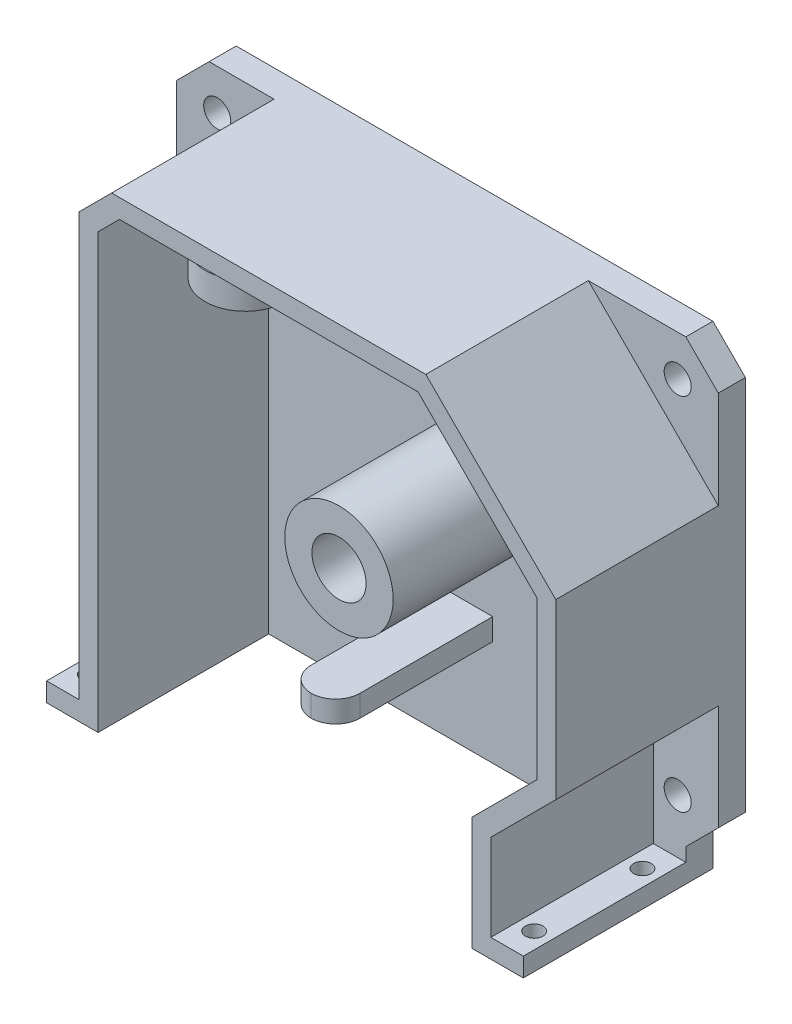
ISO-10303-21;
HEADER;
FILE_DESCRIPTION(('STEP AP214'),'2;1');
FILE_NAME('part.step','',(''),(''),'','','');
FILE_SCHEMA(('AUTOMOTIVE_DESIGN { 1 0 10303 214 1 1 1 1 }'));
ENDSEC;
DATA;
#1=APPLICATION_CONTEXT('core data for automotive mechanical design processes');
#2=APPLICATION_PROTOCOL_DEFINITION('international standard','automotive_design',2000,#1);
#3=PRODUCT_CONTEXT('',#1,'mechanical');
#4=PRODUCT('Part','Part','',(#3));
#5=PRODUCT_RELATED_PRODUCT_CATEGORY('part','',(#4));
#6=PRODUCT_DEFINITION_FORMATION('','',#4);
#7=PRODUCT_DEFINITION_CONTEXT('part definition',#1,'design');
#8=PRODUCT_DEFINITION('design','',#6,#7);
#9=PRODUCT_DEFINITION_SHAPE('','',#8);
#10=(LENGTH_UNIT() NAMED_UNIT(*) SI_UNIT(.MILLI.,.METRE.));
#11=(NAMED_UNIT(*) PLANE_ANGLE_UNIT() SI_UNIT($,.RADIAN.));
#12=(NAMED_UNIT(*) SI_UNIT($,.STERADIAN.) SOLID_ANGLE_UNIT());
#13=UNCERTAINTY_MEASURE_WITH_UNIT(LENGTH_MEASURE(1.E-05),#10,'distance_accuracy_value','');
#14=(GEOMETRIC_REPRESENTATION_CONTEXT(3) GLOBAL_UNCERTAINTY_ASSIGNED_CONTEXT((#13)) GLOBAL_UNIT_ASSIGNED_CONTEXT((#10,
#11,#12)) REPRESENTATION_CONTEXT('',''));
#15=CARTESIAN_POINT('',(0.,0.,0.));
#16=DIRECTION('',(0.,0.,1.));
#17=DIRECTION('',(1.,0.,0.));
#18=AXIS2_PLACEMENT_3D('',#15,#16,#17);
#19=CARTESIAN_POINT('',(0.,175.,7.));
#20=DIRECTION('',(0.,0.,-1.));
#21=DIRECTION('',(-1.,0.,0.));
#22=AXIS2_PLACEMENT_3D('',#19,#20,#21);
#23=PLANE('',#22);
#24=CARTESIAN_POINT('',(118.95,96.,7.));
#25=DIRECTION('',(0.,0.,-1.));
#26=DIRECTION('',(-1.,0.,0.));
#27=AXIS2_PLACEMENT_3D('',#24,#25,#26);
#28=CIRCLE('',#27,20.);
#29=CARTESIAN_POINT('',(98.95,96.,7.));
#30=VERTEX_POINT('',#29);
#31=EDGE_CURVE('E373',#30,#30,#28,.F.);
#32=ORIENTED_EDGE('',*,*,#31,.F.);
#33=EDGE_LOOP('',(#32));
#34=FACE_BOUND('',#33,.T.);
#35=DIRECTION('',(0.707106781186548,0.707106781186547,0.));
#36=VECTOR('',#35,1.);
#37=CARTESIAN_POINT('',(151.050252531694,23.9497474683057,7.));
#38=LINE('',#37,#36);
#39=CARTESIAN_POINT('',(169.,41.8994949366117,7.));
#40=VERTEX_POINT('',#39);
#41=CARTESIAN_POINT('',(193.,65.8994949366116,7.));
#42=VERTEX_POINT('',#41);
#43=EDGE_CURVE('E343',#40,#42,#38,.T.);
#44=ORIENTED_EDGE('',*,*,#43,.T.);
#45=DIRECTION('',(0.,1.,0.));
#46=VECTOR('',#45,1.);
#47=CARTESIAN_POINT('',(193.,175.,7.));
#48=LINE('',#47,#46);
#49=CARTESIAN_POINT('',(193.,124.100505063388,7.));
#50=VERTEX_POINT('',#49);
#51=EDGE_CURVE('E294',#42,#50,#48,.T.);
#52=ORIENTED_EDGE('',*,*,#51,.T.);
#53=DIRECTION('',(-0.707106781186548,0.707106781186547,0.));
#54=VECTOR('',#53,1.);
#55=CARTESIAN_POINT('',(71.0502525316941,246.050252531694,7.));
#56=LINE('',#55,#54);
#57=CARTESIAN_POINT('',(149.100505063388,168.,7.));
#58=VERTEX_POINT('',#57);
#59=EDGE_CURVE('E341',#50,#58,#56,.T.);
#60=ORIENTED_EDGE('',*,*,#59,.T.);
#61=DIRECTION('',(-1.,0.,0.));
#62=VECTOR('',#61,1.);
#63=CARTESIAN_POINT('',(0.,168.,7.));
#64=LINE('',#63,#62);
#65=CARTESIAN_POINT('',(38.8994949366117,168.,7.));
#66=VERTEX_POINT('',#65);
#67=EDGE_CURVE('E290',#58,#66,#64,.T.);
#68=ORIENTED_EDGE('',*,*,#67,.T.);
#69=DIRECTION('',(0.707106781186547,0.707106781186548,0.));
#70=VECTOR('',#69,1.);
#71=CARTESIAN_POINT('',(40.9497474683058,170.050252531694,7.00000000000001));
#72=LINE('',#71,#70);
#73=CARTESIAN_POINT('',(31.,160.100505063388,7.00000000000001));
#74=VERTEX_POINT('',#73);
#75=EDGE_CURVE('E293',#74,#66,#72,.T.);
#76=ORIENTED_EDGE('',*,*,#75,.F.);
#77=DIRECTION('',(0.,-1.,0.));
#78=VECTOR('',#77,1.);
#79=CARTESIAN_POINT('',(31.,175.,7.));
#80=LINE('',#79,#78);
#81=CARTESIAN_POINT('',(31.,0.,7.));
#82=VERTEX_POINT('',#81);
#83=EDGE_CURVE('E345',#74,#82,#80,.T.);
#84=ORIENTED_EDGE('',*,*,#83,.T.);
#85=DIRECTION('',(1.,0.,0.));
#86=VECTOR('',#85,1.);
#87=CARTESIAN_POINT('',(0.,0.,7.));
#88=LINE('',#87,#86);
#89=CARTESIAN_POINT('',(169.,0.,7.00000000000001));
#90=VERTEX_POINT('',#89);
#91=EDGE_CURVE('E297',#82,#90,#88,.T.);
#92=ORIENTED_EDGE('',*,*,#91,.T.);
#93=DIRECTION('',(0.,-1.,0.));
#94=VECTOR('',#93,1.);
#95=CARTESIAN_POINT('',(169.,39.,7.00000000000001));
#96=LINE('',#95,#94);
#97=EDGE_CURVE('E348',#40,#90,#96,.T.);
#98=ORIENTED_EDGE('',*,*,#97,.F.);
#99=EDGE_LOOP('',(#44,#52,#60,#68,#76,#84,#92,#98));
#100=FACE_BOUND('',#99,.T.);
#101=DIRECTION('',(0.,-1.,0.));
#102=VECTOR('',#101,1.);
#103=CARTESIAN_POINT('',(95.7,46.9,7.));
#104=LINE('',#103,#102);
#105=CARTESIAN_POINT('',(95.7,46.9,7.));
#106=VERTEX_POINT('',#105);
#107=CARTESIAN_POINT('',(95.7,38.9,7.));
#108=VERTEX_POINT('',#107);
#109=EDGE_CURVE('E246',#106,#108,#104,.T.);
#110=ORIENTED_EDGE('',*,*,#109,.F.);
#111=DIRECTION('',(-1.,0.,0.));
#112=VECTOR('',#111,1.);
#113=CARTESIAN_POINT('',(95.7,46.9,7.));
#114=LINE('',#113,#112);
#115=CARTESIAN_POINT('',(113.7,46.9,7.));
#116=VERTEX_POINT('',#115);
#117=EDGE_CURVE('E252',#116,#106,#114,.T.);
#118=ORIENTED_EDGE('',*,*,#117,.F.);
#119=DIRECTION('',(0.,1.,0.));
#120=VECTOR('',#119,1.);
#121=CARTESIAN_POINT('',(113.7,46.9,7.));
#122=LINE('',#121,#120);
#123=CARTESIAN_POINT('',(113.7,38.9,7.));
#124=VERTEX_POINT('',#123);
#125=EDGE_CURVE('E265',#124,#116,#122,.T.);
#126=ORIENTED_EDGE('',*,*,#125,.F.);
#127=DIRECTION('',(1.,0.,0.));
#128=VECTOR('',#127,1.);
#129=CARTESIAN_POINT('',(95.7,38.9,7.));
#130=LINE('',#129,#128);
#131=EDGE_CURVE('E260',#108,#124,#130,.T.);
#132=ORIENTED_EDGE('',*,*,#131,.F.);
#133=EDGE_LOOP('',(#110,#118,#126,#132));
#134=FACE_BOUND('',#133,.T.);
#135=ADVANCED_FACE('F26',(#34,#100,#134),#23,.F.);
#136=CARTESIAN_POINT('',(0.,168.,10.));
#137=DIRECTION('',(0.,-1.,0.));
#138=DIRECTION('',(0.,0.,-1.));
#139=AXIS2_PLACEMENT_3D('',#136,#137,#138);
#140=PLANE('',#139);
#141=DIRECTION('',(-1.,0.,0.));
#142=VECTOR('',#141,1.);
#143=CARTESIAN_POINT('',(0.,168.,70.));
#144=LINE('',#143,#142);
#145=CARTESIAN_POINT('',(149.100505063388,168.,70.));
#146=VERTEX_POINT('',#145);
#147=CARTESIAN_POINT('',(74.7905728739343,168.,70.));
#148=VERTEX_POINT('',#147);
#149=EDGE_CURVE('E333',#146,#148,#144,.T.);
#150=ORIENTED_EDGE('',*,*,#149,.T.);
#151=CARTESIAN_POINT('',(70.95,168.,55.5));
#152=DIRECTION('',(0.,-1.,0.));
#153=DIRECTION('',(0.,0.,-1.));
#154=AXIS2_PLACEMENT_3D('',#151,#152,#153);
#155=CIRCLE('',#154,15.);
#156=CARTESIAN_POINT('',(67.1094271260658,168.,70.));
#157=VERTEX_POINT('',#156);
#158=EDGE_CURVE('E376',#148,#157,#155,.F.);
#159=ORIENTED_EDGE('',*,*,#158,.T.);
#160=CARTESIAN_POINT('',(38.8994949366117,168.,70.));
#161=VERTEX_POINT('',#160);
#162=EDGE_CURVE('E332',#157,#161,#144,.T.);
#163=ORIENTED_EDGE('',*,*,#162,.T.);
#164=DIRECTION('',(0.,0.,-1.));
#165=VECTOR('',#164,1.);
#166=CARTESIAN_POINT('',(38.8994949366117,168.,70.));
#167=LINE('',#166,#165);
#168=EDGE_CURVE('E306',#161,#66,#167,.T.);
#169=ORIENTED_EDGE('',*,*,#168,.T.);
#170=ORIENTED_EDGE('',*,*,#67,.F.);
#171=DIRECTION('',(0.,0.,-1.));
#172=VECTOR('',#171,1.);
#173=CARTESIAN_POINT('',(149.100505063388,168.,10.));
#174=LINE('',#173,#172);
#175=EDGE_CURVE('E302',#146,#58,#174,.T.);
#176=ORIENTED_EDGE('',*,*,#175,.F.);
#177=EDGE_LOOP('',(#150,#159,#163,#169,#170,#176));
#178=FACE_BOUND('',#177,.T.);
#179=ADVANCED_FACE('F679',(#178),#140,.T.);
#180=CARTESIAN_POINT('',(0.,0.,10.));
#181=DIRECTION('',(0.,1.,0.));
#182=DIRECTION('',(0.,0.,1.));
#183=AXIS2_PLACEMENT_3D('',#180,#181,#182);
#184=PLANE('',#183);
#185=CARTESIAN_POINT('',(182.,0.,60.));
#186=DIRECTION('',(0.,-1.,0.));
#187=DIRECTION('',(0.,0.,1.));
#188=AXIS2_PLACEMENT_3D('',#185,#186,#187);
#189=CIRCLE('',#188,3.25000000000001);
#190=CARTESIAN_POINT('',(182.,0.,63.25));
#191=VERTEX_POINT('',#190);
#192=EDGE_CURVE('E445',#191,#191,#189,.T.);
#193=ORIENTED_EDGE('',*,*,#192,.F.);
#194=EDGE_LOOP('',(#193));
#195=FACE_BOUND('',#194,.T.);
#196=CARTESIAN_POINT('',(182.,0.,20.));
#197=DIRECTION('',(0.,-1.,0.));
#198=DIRECTION('',(0.,0.,1.));
#199=AXIS2_PLACEMENT_3D('',#196,#197,#198);
#200=CIRCLE('',#199,3.25000000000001);
#201=CARTESIAN_POINT('',(182.,0.,23.25));
#202=VERTEX_POINT('',#201);
#203=EDGE_CURVE('E439',#202,#202,#200,.T.);
#204=ORIENTED_EDGE('',*,*,#203,.F.);
#205=EDGE_LOOP('',(#204));
#206=FACE_BOUND('',#205,.T.);
#207=CARTESIAN_POINT('',(18.,0.,20.));
#208=DIRECTION('',(0.,-1.,0.));
#209=DIRECTION('',(0.,0.,-1.));
#210=AXIS2_PLACEMENT_3D('',#207,#208,#209);
#211=CIRCLE('',#210,3.25);
#212=CARTESIAN_POINT('',(18.,0.,16.75));
#213=VERTEX_POINT('',#212);
#214=EDGE_CURVE('E435',#213,#213,#211,.T.);
#215=ORIENTED_EDGE('',*,*,#214,.F.);
#216=EDGE_LOOP('',(#215));
#217=FACE_BOUND('',#216,.T.);
#218=CARTESIAN_POINT('',(18.,0.,60.));
#219=DIRECTION('',(0.,-1.,0.));
#220=DIRECTION('',(0.,0.,-1.));
#221=AXIS2_PLACEMENT_3D('',#218,#219,#220);
#222=CIRCLE('',#221,3.25);
#223=CARTESIAN_POINT('',(18.,0.,56.75));
#224=VERTEX_POINT('',#223);
#225=EDGE_CURVE('E429',#224,#224,#222,.T.);
#226=ORIENTED_EDGE('',*,*,#225,.F.);
#227=EDGE_LOOP('',(#226));
#228=FACE_BOUND('',#227,.T.);
#229=DIRECTION('',(0.,0.,-1.));
#230=VECTOR('',#229,1.);
#231=CARTESIAN_POINT('',(31.,0.,70.));
#232=LINE('',#231,#230);
#233=CARTESIAN_POINT('',(31.,0.,70.));
#234=VERTEX_POINT('',#233);
#235=EDGE_CURVE('E314',#234,#82,#232,.T.);
#236=ORIENTED_EDGE('',*,*,#235,.F.);
#237=DIRECTION('',(1.,0.,0.));
#238=VECTOR('',#237,1.);
#239=CARTESIAN_POINT('',(12.,0.,70.));
#240=LINE('',#239,#238);
#241=CARTESIAN_POINT('',(12.,0.,70.));
#242=VERTEX_POINT('',#241);
#243=EDGE_CURVE('E608',#242,#234,#240,.T.);
#244=ORIENTED_EDGE('',*,*,#243,.F.);
#245=DIRECTION('',(0.,0.,1.));
#246=VECTOR('',#245,1.);
#247=CARTESIAN_POINT('',(12.,0.,0.));
#248=LINE('',#247,#246);
#249=CARTESIAN_POINT('',(12.,0.,0.));
#250=VERTEX_POINT('',#249);
#251=EDGE_CURVE('E572',#250,#242,#248,.T.);
#252=ORIENTED_EDGE('',*,*,#251,.F.);
#253=DIRECTION('',(1.,0.,0.));
#254=VECTOR('',#253,1.);
#255=CARTESIAN_POINT('',(0.,0.,0.));
#256=LINE('',#255,#254);
#257=CARTESIAN_POINT('',(188.,0.,0.));
#258=VERTEX_POINT('',#257);
#259=EDGE_CURVE('E563',#250,#258,#256,.T.);
#260=ORIENTED_EDGE('',*,*,#259,.T.);
#261=DIRECTION('',(0.,0.,1.));
#262=VECTOR('',#261,1.);
#263=CARTESIAN_POINT('',(188.,0.,0.));
#264=LINE('',#263,#262);
#265=CARTESIAN_POINT('',(188.,0.,70.));
#266=VERTEX_POINT('',#265);
#267=EDGE_CURVE('E592',#258,#266,#264,.T.);
#268=ORIENTED_EDGE('',*,*,#267,.T.);
#269=CARTESIAN_POINT('',(169.,0.,70.));
#270=VERTEX_POINT('',#269);
#271=EDGE_CURVE('E602',#270,#266,#240,.T.);
#272=ORIENTED_EDGE('',*,*,#271,.F.);
#273=DIRECTION('',(0.,0.,-1.));
#274=VECTOR('',#273,1.);
#275=CARTESIAN_POINT('',(169.,0.,70.));
#276=LINE('',#275,#274);
#277=EDGE_CURVE('E317',#270,#90,#276,.T.);
#278=ORIENTED_EDGE('',*,*,#277,.T.);
#279=ORIENTED_EDGE('',*,*,#91,.F.);
#280=EDGE_LOOP('',(#236,#244,#252,#260,#268,#272,#278,#279));
#281=FACE_BOUND('',#280,.T.);
#282=ADVANCED_FACE('F685',(#195,#206,#217,#228,#281),#184,.F.);
#283=CARTESIAN_POINT('',(0.,175.,10.));
#284=DIRECTION('',(0.,0.,-1.));
#285=DIRECTION('',(-1.,0.,0.));
#286=AXIS2_PLACEMENT_3D('',#283,#284,#285);
#287=PLANE('',#286);
#288=CARTESIAN_POINT('',(15.,27.,10.));
#289=DIRECTION('',(0.,0.,1.));
#290=DIRECTION('',(1.,0.,0.));
#291=AXIS2_PLACEMENT_3D('',#288,#289,#290);
#292=CIRCLE('',#291,5.);
#293=CARTESIAN_POINT('',(20.,27.,10.));
#294=VERTEX_POINT('',#293);
#295=EDGE_CURVE('E411',#294,#294,#292,.T.);
#296=ORIENTED_EDGE('',*,*,#295,.F.);
#297=EDGE_LOOP('',(#296));
#298=FACE_BOUND('',#297,.T.);
#299=CARTESIAN_POINT('',(15.,160.,10.));
#300=DIRECTION('',(0.,0.,1.));
#301=DIRECTION('',(1.,0.,0.));
#302=AXIS2_PLACEMENT_3D('',#299,#300,#301);
#303=CIRCLE('',#302,5.);
#304=CARTESIAN_POINT('',(20.,160.,10.));
#305=VERTEX_POINT('',#304);
#306=EDGE_CURVE('E405',#305,#305,#303,.T.);
#307=ORIENTED_EDGE('',*,*,#306,.F.);
#308=EDGE_LOOP('',(#307));
#309=FACE_BOUND('',#308,.T.);
#310=DIRECTION('',(-1.,0.,0.));
#311=VECTOR('',#310,1.);
#312=CARTESIAN_POINT('',(12.,7.,10.));
#313=LINE('',#312,#311);
#314=CARTESIAN_POINT('',(24.,7.,10.));
#315=VERTEX_POINT('',#314);
#316=CARTESIAN_POINT('',(12.,7.,10.));
#317=VERTEX_POINT('',#316);
#318=EDGE_CURVE('E598',#315,#317,#313,.T.);
#319=ORIENTED_EDGE('',*,*,#318,.F.);
#320=DIRECTION('',(0.,-1.,0.));
#321=VECTOR('',#320,1.);
#322=CARTESIAN_POINT('',(24.,163.,10.));
#323=LINE('',#322,#321);
#324=CARTESIAN_POINT('',(24.,163.,10.));
#325=VERTEX_POINT('',#324);
#326=EDGE_CURVE('E603',#325,#315,#323,.T.);
#327=ORIENTED_EDGE('',*,*,#326,.F.);
#328=DIRECTION('',(-0.707106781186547,-0.707106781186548,0.));
#329=VECTOR('',#328,1.);
#330=CARTESIAN_POINT('',(36.,175.,10.));
#331=LINE('',#330,#329);
#332=CARTESIAN_POINT('',(36.,175.,10.));
#333=VERTEX_POINT('',#332);
#334=EDGE_CURVE('E528',#333,#325,#331,.T.);
#335=ORIENTED_EDGE('',*,*,#334,.F.);
#336=DIRECTION('',(-1.,0.,0.));
#337=VECTOR('',#336,1.);
#338=CARTESIAN_POINT('',(0.,175.,10.));
#339=LINE('',#338,#337);
#340=CARTESIAN_POINT('',(12.0000000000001,175.,10.));
#341=VERTEX_POINT('',#340);
#342=EDGE_CURVE('E498',#333,#341,#339,.T.);
#343=ORIENTED_EDGE('',*,*,#342,.T.);
#344=DIRECTION('',(0.70710678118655,0.707106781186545,0.));
#345=VECTOR('',#344,1.);
#346=CARTESIAN_POINT('',(0.,163.,10.));
#347=LINE('',#346,#345);
#348=CARTESIAN_POINT('',(0.,163.,10.));
#349=VERTEX_POINT('',#348);
#350=EDGE_CURVE('E525',#341,#349,#347,.F.);
#351=ORIENTED_EDGE('',*,*,#350,.T.);
#352=DIRECTION('',(0.,-1.,0.));
#353=VECTOR('',#352,1.);
#354=CARTESIAN_POINT('',(0.,0.,10.));
#355=LINE('',#354,#353);
#356=CARTESIAN_POINT('',(0.,24.,10.));
#357=VERTEX_POINT('',#356);
#358=EDGE_CURVE('E504',#349,#357,#355,.T.);
#359=ORIENTED_EDGE('',*,*,#358,.T.);
#360=DIRECTION('',(-0.707106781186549,0.707106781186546,0.));
#361=VECTOR('',#360,1.);
#362=CARTESIAN_POINT('',(0.,24.,10.));
#363=LINE('',#362,#361);
#364=CARTESIAN_POINT('',(12.,12.,10.));
#365=VERTEX_POINT('',#364);
#366=EDGE_CURVE('E585',#365,#357,#363,.T.);
#367=ORIENTED_EDGE('',*,*,#366,.F.);
#368=DIRECTION('',(0.,1.,0.));
#369=VECTOR('',#368,1.);
#370=CARTESIAN_POINT('',(12.,12.,10.));
#371=LINE('',#370,#369);
#372=EDGE_CURVE('E587',#317,#365,#371,.T.);
#373=ORIENTED_EDGE('',*,*,#372,.F.);
#374=EDGE_LOOP('',(#319,#327,#335,#343,#351,#359,#367,#373));
#375=FACE_BOUND('',#374,.T.);
#376=ADVANCED_FACE('F522',(#298,#309,#375),#287,.F.);
#377=CARTESIAN_POINT('',(185.,160.,10.));
#378=DIRECTION('',(0.,0.,1.));
#379=DIRECTION('',(1.,0.,0.));
#380=AXIS2_PLACEMENT_3D('',#377,#378,#379);
#381=CIRCLE('',#380,5.);
#382=CARTESIAN_POINT('',(190.,160.,10.));
#383=VERTEX_POINT('',#382);
#384=EDGE_CURVE('E417',#383,#383,#381,.T.);
#385=ORIENTED_EDGE('',*,*,#384,.F.);
#386=EDGE_LOOP('',(#385));
#387=FACE_BOUND('',#386,.T.);
#388=DIRECTION('',(-0.707106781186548,0.707106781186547,0.));
#389=VECTOR('',#388,1.);
#390=CARTESIAN_POINT('',(200.,127.,10.));
#391=LINE('',#390,#389);
#392=CARTESIAN_POINT('',(200.,127.,10.));
#393=VERTEX_POINT('',#392);
#394=CARTESIAN_POINT('',(152.,175.,10.));
#395=VERTEX_POINT('',#394);
#396=EDGE_CURVE('E363',#393,#395,#391,.T.);
#397=ORIENTED_EDGE('',*,*,#396,.F.);
#398=DIRECTION('',(0.,1.,0.));
#399=VECTOR('',#398,1.);
#400=CARTESIAN_POINT('',(200.,0.,10.));
#401=LINE('',#400,#399);
#402=CARTESIAN_POINT('',(200.,163.,10.));
#403=VERTEX_POINT('',#402);
#404=EDGE_CURVE('E499',#393,#403,#401,.T.);
#405=ORIENTED_EDGE('',*,*,#404,.T.);
#406=DIRECTION('',(0.707106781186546,-0.707106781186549,0.));
#407=VECTOR('',#406,1.);
#408=CARTESIAN_POINT('',(188.,175.,10.));
#409=LINE('',#408,#407);
#410=CARTESIAN_POINT('',(188.,175.,10.));
#411=VERTEX_POINT('',#410);
#412=EDGE_CURVE('E542',#403,#411,#409,.F.);
#413=ORIENTED_EDGE('',*,*,#412,.T.);
#414=EDGE_CURVE('E514',#411,#395,#339,.T.);
#415=ORIENTED_EDGE('',*,*,#414,.T.);
#416=EDGE_LOOP('',(#397,#405,#413,#415));
#417=FACE_BOUND('',#416,.T.);
#418=ADVANCED_FACE('F666',(#387,#417),#287,.F.);
#419=CARTESIAN_POINT('',(185.,27.,10.));
#420=DIRECTION('',(0.,0.,1.));
#421=DIRECTION('',(1.,0.,0.));
#422=AXIS2_PLACEMENT_3D('',#419,#420,#421);
#423=CIRCLE('',#422,5.);
#424=CARTESIAN_POINT('',(190.,27.,10.));
#425=VERTEX_POINT('',#424);
#426=EDGE_CURVE('E423',#425,#425,#423,.T.);
#427=ORIENTED_EDGE('',*,*,#426,.F.);
#428=EDGE_LOOP('',(#427));
#429=FACE_BOUND('',#428,.T.);
#430=DIRECTION('',(0.707106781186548,0.707106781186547,0.));
#431=VECTOR('',#430,1.);
#432=CARTESIAN_POINT('',(200.,63.,10.));
#433=LINE('',#432,#431);
#434=CARTESIAN_POINT('',(176.,39.,10.));
#435=VERTEX_POINT('',#434);
#436=CARTESIAN_POINT('',(200.,63.,10.));
#437=VERTEX_POINT('',#436);
#438=EDGE_CURVE('E354',#435,#437,#433,.T.);
#439=ORIENTED_EDGE('',*,*,#438,.F.);
#440=DIRECTION('',(0.,1.,0.));
#441=VECTOR('',#440,1.);
#442=CARTESIAN_POINT('',(176.,39.,10.));
#443=LINE('',#442,#441);
#444=CARTESIAN_POINT('',(176.,7.00000000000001,10.));
#445=VERTEX_POINT('',#444);
#446=EDGE_CURVE('E351',#445,#435,#443,.T.);
#447=ORIENTED_EDGE('',*,*,#446,.F.);
#448=DIRECTION('',(-1.,0.,0.));
#449=VECTOR('',#448,1.);
#450=CARTESIAN_POINT('',(176.,7.00000000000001,10.));
#451=LINE('',#450,#449);
#452=CARTESIAN_POINT('',(188.,7.00000000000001,10.));
#453=VERTEX_POINT('',#452);
#454=EDGE_CURVE('E350',#453,#445,#451,.T.);
#455=ORIENTED_EDGE('',*,*,#454,.F.);
#456=DIRECTION('',(0.,-1.,0.));
#457=VECTOR('',#456,1.);
#458=CARTESIAN_POINT('',(188.,12.,10.));
#459=LINE('',#458,#457);
#460=CARTESIAN_POINT('',(188.,12.,10.));
#461=VERTEX_POINT('',#460);
#462=EDGE_CURVE('E486',#461,#453,#459,.T.);
#463=ORIENTED_EDGE('',*,*,#462,.F.);
#464=DIRECTION('',(-0.707106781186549,-0.707106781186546,0.));
#465=VECTOR('',#464,1.);
#466=CARTESIAN_POINT('',(200.,24.,10.));
#467=LINE('',#466,#465);
#468=CARTESIAN_POINT('',(200.,24.,10.));
#469=VERTEX_POINT('',#468);
#470=EDGE_CURVE('E479',#469,#461,#467,.T.);
#471=ORIENTED_EDGE('',*,*,#470,.F.);
#472=EDGE_CURVE('E495',#469,#437,#401,.T.);
#473=ORIENTED_EDGE('',*,*,#472,.T.);
#474=EDGE_LOOP('',(#439,#447,#455,#463,#471,#473));
#475=FACE_BOUND('',#474,.T.);
#476=ADVANCED_FACE('F817',(#429,#475),#287,.F.);
#477=CARTESIAN_POINT('',(0.,0.,10.));
#478=DIRECTION('',(1.,0.,0.));
#479=DIRECTION('',(0.,0.,-1.));
#480=AXIS2_PLACEMENT_3D('',#477,#478,#479);
#481=PLANE('',#480);
#482=DIRECTION('',(0.,-1.,0.));
#483=VECTOR('',#482,1.);
#484=CARTESIAN_POINT('',(0.,0.,0.));
#485=LINE('',#484,#483);
#486=CARTESIAN_POINT('',(0.,163.,0.));
#487=VERTEX_POINT('',#486);
#488=CARTESIAN_POINT('',(0.,24.,0.));
#489=VERTEX_POINT('',#488);
#490=EDGE_CURVE('E568',#487,#489,#485,.T.);
#491=ORIENTED_EDGE('',*,*,#490,.T.);
#492=DIRECTION('',(0.,0.,1.));
#493=VECTOR('',#492,1.);
#494=CARTESIAN_POINT('',(0.,24.,0.));
#495=LINE('',#494,#493);
#496=EDGE_CURVE('E571',#489,#357,#495,.T.);
#497=ORIENTED_EDGE('',*,*,#496,.T.);
#498=ORIENTED_EDGE('',*,*,#358,.F.);
#499=DIRECTION('',(0.,0.,-1.));
#500=VECTOR('',#499,1.);
#501=CARTESIAN_POINT('',(0.,163.,10.));
#502=LINE('',#501,#500);
#503=EDGE_CURVE('E377',#349,#487,#502,.T.);
#504=ORIENTED_EDGE('',*,*,#503,.T.);
#505=EDGE_LOOP('',(#491,#497,#498,#504));
#506=FACE_BOUND('',#505,.T.);
#507=ADVANCED_FACE('F28',(#506),#481,.F.);
#508=CARTESIAN_POINT('',(200.,0.,10.));
#509=DIRECTION('',(-1.,0.,0.));
#510=DIRECTION('',(0.,0.,1.));
#511=AXIS2_PLACEMENT_3D('',#508,#509,#510);
#512=PLANE('',#511);
#513=ORIENTED_EDGE('',*,*,#472,.F.);
#514=DIRECTION('',(0.,0.,1.));
#515=VECTOR('',#514,1.);
#516=CARTESIAN_POINT('',(200.,24.,0.));
#517=LINE('',#516,#515);
#518=CARTESIAN_POINT('',(200.,24.,0.));
#519=VERTEX_POINT('',#518);
#520=EDGE_CURVE('E590',#519,#469,#517,.T.);
#521=ORIENTED_EDGE('',*,*,#520,.F.);
#522=DIRECTION('',(0.,1.,0.));
#523=VECTOR('',#522,1.);
#524=CARTESIAN_POINT('',(200.,0.,0.));
#525=LINE('',#524,#523);
#526=CARTESIAN_POINT('',(200.,163.,0.));
#527=VERTEX_POINT('',#526);
#528=EDGE_CURVE('E562',#519,#527,#525,.T.);
#529=ORIENTED_EDGE('',*,*,#528,.T.);
#530=DIRECTION('',(0.,0.,1.));
#531=VECTOR('',#530,1.);
#532=CARTESIAN_POINT('',(200.,163.,10.));
#533=LINE('',#532,#531);
#534=EDGE_CURVE('E543',#527,#403,#533,.T.);
#535=ORIENTED_EDGE('',*,*,#534,.T.);
#536=ORIENTED_EDGE('',*,*,#404,.F.);
#537=DIRECTION('',(0.,0.,-1.));
#538=VECTOR('',#537,1.);
#539=CARTESIAN_POINT('',(200.,127.,70.));
#540=LINE('',#539,#538);
#541=CARTESIAN_POINT('',(200.,127.,70.));
#542=VERTEX_POINT('',#541);
#543=EDGE_CURVE('E370',#542,#393,#540,.T.);
#544=ORIENTED_EDGE('',*,*,#543,.F.);
#545=DIRECTION('',(0.,1.,0.));
#546=VECTOR('',#545,1.);
#547=CARTESIAN_POINT('',(200.,63.,70.));
#548=LINE('',#547,#546);
#549=CARTESIAN_POINT('',(200.,63.,70.));
#550=VERTEX_POINT('',#549);
#551=EDGE_CURVE('E618',#550,#542,#548,.T.);
#552=ORIENTED_EDGE('',*,*,#551,.F.);
#553=DIRECTION('',(0.,0.,-1.));
#554=VECTOR('',#553,1.);
#555=CARTESIAN_POINT('',(200.,63.,70.));
#556=LINE('',#555,#554);
#557=EDGE_CURVE('E366',#550,#437,#556,.T.);
#558=ORIENTED_EDGE('',*,*,#557,.T.);
#559=EDGE_LOOP('',(#513,#521,#529,#535,#536,#544,#552,#558));
#560=FACE_BOUND('',#559,.T.);
#561=ADVANCED_FACE('F665',(#560),#512,.F.);
#562=CARTESIAN_POINT('',(0.,175.,10.));
#563=DIRECTION('',(0.,-1.,0.));
#564=DIRECTION('',(0.,0.,-1.));
#565=AXIS2_PLACEMENT_3D('',#562,#563,#564);
#566=PLANE('',#565);
#567=ORIENTED_EDGE('',*,*,#414,.F.);
#568=DIRECTION('',(0.,0.,-1.));
#569=VECTOR('',#568,1.);
#570=CARTESIAN_POINT('',(188.,175.,10.));
#571=LINE('',#570,#569);
#572=CARTESIAN_POINT('',(188.,175.,0.));
#573=VERTEX_POINT('',#572);
#574=EDGE_CURVE('E519',#411,#573,#571,.T.);
#575=ORIENTED_EDGE('',*,*,#574,.T.);
#576=DIRECTION('',(-1.,0.,0.));
#577=VECTOR('',#576,1.);
#578=CARTESIAN_POINT('',(0.,175.,0.));
#579=LINE('',#578,#577);
#580=CARTESIAN_POINT('',(12.0000000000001,175.,0.));
#581=VERTEX_POINT('',#580);
#582=EDGE_CURVE('E537',#573,#581,#579,.T.);
#583=ORIENTED_EDGE('',*,*,#582,.T.);
#584=DIRECTION('',(0.,0.,1.));
#585=VECTOR('',#584,1.);
#586=CARTESIAN_POINT('',(12.0000000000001,175.,10.));
#587=LINE('',#586,#585);
#588=EDGE_CURVE('E509',#581,#341,#587,.T.);
#589=ORIENTED_EDGE('',*,*,#588,.T.);
#590=ORIENTED_EDGE('',*,*,#342,.F.);
#591=DIRECTION('',(0.,0.,-1.));
#592=VECTOR('',#591,1.);
#593=CARTESIAN_POINT('',(36.,175.,70.));
#594=LINE('',#593,#592);
#595=CARTESIAN_POINT('',(36.,175.,70.));
#596=VERTEX_POINT('',#595);
#597=EDGE_CURVE('E637',#596,#333,#594,.T.);
#598=ORIENTED_EDGE('',*,*,#597,.F.);
#599=DIRECTION('',(-1.,0.,0.));
#600=VECTOR('',#599,1.);
#601=CARTESIAN_POINT('',(152.,175.,70.));
#602=LINE('',#601,#600);
#603=CARTESIAN_POINT('',(152.,175.,70.));
#604=VERTEX_POINT('',#603);
#605=EDGE_CURVE('E622',#604,#596,#602,.T.);
#606=ORIENTED_EDGE('',*,*,#605,.F.);
#607=DIRECTION('',(0.,0.,-1.));
#608=VECTOR('',#607,1.);
#609=CARTESIAN_POINT('',(152.,175.,70.));
#610=LINE('',#609,#608);
#611=EDGE_CURVE('E642',#604,#395,#610,.T.);
#612=ORIENTED_EDGE('',*,*,#611,.T.);
#613=EDGE_LOOP('',(#567,#575,#583,#589,#590,#598,#606,#612));
#614=FACE_BOUND('',#613,.T.);
#615=ADVANCED_FACE('F534',(#614),#566,.F.);
#616=CARTESIAN_POINT('',(0.,175.,0.));
#617=DIRECTION('',(0.,0.,-1.));
#618=DIRECTION('',(-1.,0.,0.));
#619=AXIS2_PLACEMENT_3D('',#616,#617,#618);
#620=PLANE('',#619);
#621=CARTESIAN_POINT('',(185.,27.,0.));
#622=DIRECTION('',(0.,0.,1.));
#623=DIRECTION('',(1.,0.,0.));
#624=AXIS2_PLACEMENT_3D('',#621,#622,#623);
#625=CIRCLE('',#624,5.);
#626=CARTESIAN_POINT('',(190.,27.,0.));
#627=VERTEX_POINT('',#626);
#628=EDGE_CURVE('E420',#627,#627,#625,.T.);
#629=ORIENTED_EDGE('',*,*,#628,.T.);
#630=EDGE_LOOP('',(#629));
#631=FACE_BOUND('',#630,.T.);
#632=CARTESIAN_POINT('',(185.,160.,0.));
#633=DIRECTION('',(0.,0.,1.));
#634=DIRECTION('',(1.,0.,0.));
#635=AXIS2_PLACEMENT_3D('',#632,#633,#634);
#636=CIRCLE('',#635,5.);
#637=CARTESIAN_POINT('',(190.,160.,0.));
#638=VERTEX_POINT('',#637);
#639=EDGE_CURVE('E414',#638,#638,#636,.T.);
#640=ORIENTED_EDGE('',*,*,#639,.T.);
#641=EDGE_LOOP('',(#640));
#642=FACE_BOUND('',#641,.T.);
#643=CARTESIAN_POINT('',(15.,27.,0.));
#644=DIRECTION('',(0.,0.,1.));
#645=DIRECTION('',(1.,0.,0.));
#646=AXIS2_PLACEMENT_3D('',#643,#644,#645);
#647=CIRCLE('',#646,5.);
#648=CARTESIAN_POINT('',(20.,27.,0.));
#649=VERTEX_POINT('',#648);
#650=EDGE_CURVE('E408',#649,#649,#647,.T.);
#651=ORIENTED_EDGE('',*,*,#650,.T.);
#652=EDGE_LOOP('',(#651));
#653=FACE_BOUND('',#652,.T.);
#654=CARTESIAN_POINT('',(15.,160.,0.));
#655=DIRECTION('',(0.,0.,1.));
#656=DIRECTION('',(1.,0.,0.));
#657=AXIS2_PLACEMENT_3D('',#654,#655,#656);
#658=CIRCLE('',#657,5.);
#659=CARTESIAN_POINT('',(20.,160.,0.));
#660=VERTEX_POINT('',#659);
#661=EDGE_CURVE('E402',#660,#660,#658,.T.);
#662=ORIENTED_EDGE('',*,*,#661,.T.);
#663=EDGE_LOOP('',(#662));
#664=FACE_BOUND('',#663,.T.);
#665=DIRECTION('',(0.,-1.,0.));
#666=VECTOR('',#665,1.);
#667=CARTESIAN_POINT('',(188.,12.,0.));
#668=LINE('',#667,#666);
#669=CARTESIAN_POINT('',(188.,12.0000000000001,0.));
#670=VERTEX_POINT('',#669);
#671=EDGE_CURVE('E820',#670,#258,#668,.T.);
#672=ORIENTED_EDGE('',*,*,#671,.T.);
#673=ORIENTED_EDGE('',*,*,#259,.F.);
#674=DIRECTION('',(0.,1.,0.));
#675=VECTOR('',#674,1.);
#676=CARTESIAN_POINT('',(12.,12.,0.));
#677=LINE('',#676,#675);
#678=CARTESIAN_POINT('',(12.,12.,0.));
#679=VERTEX_POINT('',#678);
#680=EDGE_CURVE('E582',#250,#679,#677,.T.);
#681=ORIENTED_EDGE('',*,*,#680,.T.);
#682=DIRECTION('',(-0.707106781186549,0.707106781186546,0.));
#683=VECTOR('',#682,1.);
#684=CARTESIAN_POINT('',(0.,24.,0.));
#685=LINE('',#684,#683);
#686=EDGE_CURVE('E575',#679,#489,#685,.T.);
#687=ORIENTED_EDGE('',*,*,#686,.T.);
#688=ORIENTED_EDGE('',*,*,#490,.F.);
#689=DIRECTION('',(-0.70710678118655,-0.707106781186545,0.));
#690=VECTOR('',#689,1.);
#691=CARTESIAN_POINT('',(5.99999999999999,169.,0.));
#692=LINE('',#691,#690);
#693=EDGE_CURVE('E551',#487,#581,#692,.F.);
#694=ORIENTED_EDGE('',*,*,#693,.T.);
#695=ORIENTED_EDGE('',*,*,#582,.F.);
#696=DIRECTION('',(-0.707106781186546,0.707106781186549,0.));
#697=VECTOR('',#696,1.);
#698=CARTESIAN_POINT('',(94.0000000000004,269.,0.));
#699=LINE('',#698,#697);
#700=EDGE_CURVE('E546',#573,#527,#699,.F.);
#701=ORIENTED_EDGE('',*,*,#700,.T.);
#702=ORIENTED_EDGE('',*,*,#528,.F.);
#703=DIRECTION('',(-0.707106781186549,-0.707106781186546,0.));
#704=VECTOR('',#703,1.);
#705=CARTESIAN_POINT('',(200.,24.,0.));
#706=LINE('',#705,#704);
#707=EDGE_CURVE('E489',#519,#670,#706,.T.);
#708=ORIENTED_EDGE('',*,*,#707,.T.);
#709=EDGE_LOOP('',(#672,#673,#681,#687,#688,#694,#695,#701,#702,#708));
#710=FACE_BOUND('',#709,.T.);
#711=ADVANCED_FACE('F558',(#631,#642,#653,#664,#710),#620,.T.);
#712=CARTESIAN_POINT('',(188.,175.,10.));
#713=DIRECTION('',(-0.707106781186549,-0.707106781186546,0.));
#714=DIRECTION('',(0.707106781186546,-0.707106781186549,0.));
#715=AXIS2_PLACEMENT_3D('',#712,#713,#714);
#716=PLANE('',#715);
#717=ORIENTED_EDGE('',*,*,#412,.F.);
#718=ORIENTED_EDGE('',*,*,#534,.F.);
#719=ORIENTED_EDGE('',*,*,#700,.F.);
#720=ORIENTED_EDGE('',*,*,#574,.F.);
#721=EDGE_LOOP('',(#717,#718,#719,#720));
#722=FACE_BOUND('',#721,.T.);
#723=ADVANCED_FACE('F667',(#722),#716,.F.);
#724=CARTESIAN_POINT('',(0.,163.,10.));
#725=DIRECTION('',(0.707106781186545,-0.70710678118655,0.));
#726=DIRECTION('',(0.70710678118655,0.707106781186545,0.));
#727=AXIS2_PLACEMENT_3D('',#724,#725,#726);
#728=PLANE('',#727);
#729=ORIENTED_EDGE('',*,*,#350,.F.);
#730=ORIENTED_EDGE('',*,*,#588,.F.);
#731=ORIENTED_EDGE('',*,*,#693,.F.);
#732=ORIENTED_EDGE('',*,*,#503,.F.);
#733=EDGE_LOOP('',(#729,#730,#731,#732));
#734=FACE_BOUND('',#733,.T.);
#735=ADVANCED_FACE('F540',(#734),#728,.F.);
#736=CARTESIAN_POINT('',(0.,24.,0.));
#737=DIRECTION('',(0.707106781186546,0.707106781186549,0.));
#738=DIRECTION('',(-0.707106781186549,0.707106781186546,0.));
#739=AXIS2_PLACEMENT_3D('',#736,#737,#738);
#740=PLANE('',#739);
#741=ORIENTED_EDGE('',*,*,#366,.T.);
#742=ORIENTED_EDGE('',*,*,#496,.F.);
#743=ORIENTED_EDGE('',*,*,#686,.F.);
#744=DIRECTION('',(0.,0.,1.));
#745=VECTOR('',#744,1.);
#746=CARTESIAN_POINT('',(12.,12.,0.));
#747=LINE('',#746,#745);
#748=EDGE_CURVE('E574',#679,#365,#747,.T.);
#749=ORIENTED_EDGE('',*,*,#748,.T.);
#750=EDGE_LOOP('',(#741,#742,#743,#749));
#751=FACE_BOUND('',#750,.T.);
#752=ADVANCED_FACE('F674',(#751),#740,.F.);
#753=CARTESIAN_POINT('',(12.,12.,0.));
#754=DIRECTION('',(1.,0.,0.));
#755=DIRECTION('',(0.,0.,-1.));
#756=AXIS2_PLACEMENT_3D('',#753,#754,#755);
#757=PLANE('',#756);
#758=ORIENTED_EDGE('',*,*,#251,.T.);
#759=DIRECTION('',(0.,-1.,0.));
#760=VECTOR('',#759,1.);
#761=CARTESIAN_POINT('',(12.,0.,70.));
#762=LINE('',#761,#760);
#763=CARTESIAN_POINT('',(12.,7.,70.));
#764=VERTEX_POINT('',#763);
#765=EDGE_CURVE('E630',#764,#242,#762,.T.);
#766=ORIENTED_EDGE('',*,*,#765,.F.);
#767=DIRECTION('',(0.,0.,-1.));
#768=VECTOR('',#767,1.);
#769=CARTESIAN_POINT('',(12.,7.,70.));
#770=LINE('',#769,#768);
#771=EDGE_CURVE('E604',#764,#317,#770,.T.);
#772=ORIENTED_EDGE('',*,*,#771,.T.);
#773=ORIENTED_EDGE('',*,*,#372,.T.);
#774=ORIENTED_EDGE('',*,*,#748,.F.);
#775=ORIENTED_EDGE('',*,*,#680,.F.);
#776=EDGE_LOOP('',(#758,#766,#772,#773,#774,#775));
#777=FACE_BOUND('',#776,.T.);
#778=ADVANCED_FACE('F739',(#777),#757,.F.);
#779=CARTESIAN_POINT('',(188.,12.,0.));
#780=DIRECTION('',(-1.,0.,0.));
#781=DIRECTION('',(0.,0.,1.));
#782=AXIS2_PLACEMENT_3D('',#779,#780,#781);
#783=PLANE('',#782);
#784=ORIENTED_EDGE('',*,*,#462,.T.);
#785=DIRECTION('',(0.,0.,-1.));
#786=VECTOR('',#785,1.);
#787=CARTESIAN_POINT('',(188.,7.,70.));
#788=LINE('',#787,#786);
#789=CARTESIAN_POINT('',(188.,7.,70.));
#790=VERTEX_POINT('',#789);
#791=EDGE_CURVE('E469',#790,#453,#788,.T.);
#792=ORIENTED_EDGE('',*,*,#791,.F.);
#793=DIRECTION('',(0.,1.,0.));
#794=VECTOR('',#793,1.);
#795=CARTESIAN_POINT('',(188.,0.,70.));
#796=LINE('',#795,#794);
#797=EDGE_CURVE('E611',#266,#790,#796,.T.);
#798=ORIENTED_EDGE('',*,*,#797,.F.);
#799=ORIENTED_EDGE('',*,*,#267,.F.);
#800=ORIENTED_EDGE('',*,*,#671,.F.);
#801=DIRECTION('',(0.,0.,1.));
#802=VECTOR('',#801,1.);
#803=CARTESIAN_POINT('',(188.,12.,0.));
#804=LINE('',#803,#802);
#805=EDGE_CURVE('E811',#670,#461,#804,.T.);
#806=ORIENTED_EDGE('',*,*,#805,.T.);
#807=EDGE_LOOP('',(#784,#792,#798,#799,#800,#806));
#808=FACE_BOUND('',#807,.T.);
#809=ADVANCED_FACE('F736',(#808),#783,.F.);
#810=CARTESIAN_POINT('',(200.,24.,0.));
#811=DIRECTION('',(-0.707106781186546,0.707106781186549,0.));
#812=DIRECTION('',(-0.707106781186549,-0.707106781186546,0.));
#813=AXIS2_PLACEMENT_3D('',#810,#811,#812);
#814=PLANE('',#813);
#815=ORIENTED_EDGE('',*,*,#470,.T.);
#816=ORIENTED_EDGE('',*,*,#805,.F.);
#817=ORIENTED_EDGE('',*,*,#707,.F.);
#818=ORIENTED_EDGE('',*,*,#520,.T.);
#819=EDGE_LOOP('',(#815,#816,#817,#818));
#820=FACE_BOUND('',#819,.T.);
#821=ADVANCED_FACE('F457',(#820),#814,.F.);
#822=CARTESIAN_POINT('',(176.,7.00000000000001,70.));
#823=DIRECTION('',(0.,-1.,0.));
#824=DIRECTION('',(1.,0.,0.));
#825=AXIS2_PLACEMENT_3D('',#822,#823,#824);
#826=PLANE('',#825);
#827=CARTESIAN_POINT('',(182.,7.00000000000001,60.));
#828=DIRECTION('',(0.,-1.,0.));
#829=DIRECTION('',(1.,0.,0.));
#830=AXIS2_PLACEMENT_3D('',#827,#828,#829);
#831=CIRCLE('',#830,3.25000000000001);
#832=CARTESIAN_POINT('',(185.25,7.00000000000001,60.));
#833=VERTEX_POINT('',#832);
#834=EDGE_CURVE('E442',#833,#833,#831,.F.);
#835=ORIENTED_EDGE('',*,*,#834,.F.);
#836=EDGE_LOOP('',(#835));
#837=FACE_BOUND('',#836,.T.);
#838=CARTESIAN_POINT('',(182.,7.00000000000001,20.));
#839=DIRECTION('',(0.,-1.,0.));
#840=DIRECTION('',(1.,0.,0.));
#841=AXIS2_PLACEMENT_3D('',#838,#839,#840);
#842=CIRCLE('',#841,3.25000000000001);
#843=CARTESIAN_POINT('',(185.25,7.00000000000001,20.));
#844=VERTEX_POINT('',#843);
#845=EDGE_CURVE('E438',#844,#844,#842,.F.);
#846=ORIENTED_EDGE('',*,*,#845,.F.);
#847=EDGE_LOOP('',(#846));
#848=FACE_BOUND('',#847,.T.);
#849=ORIENTED_EDGE('',*,*,#454,.T.);
#850=DIRECTION('',(0.,0.,-1.));
#851=VECTOR('',#850,1.);
#852=CARTESIAN_POINT('',(176.,7.00000000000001,70.));
#853=LINE('',#852,#851);
#854=CARTESIAN_POINT('',(176.,7.00000000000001,70.));
#855=VERTEX_POINT('',#854);
#856=EDGE_CURVE('E466',#855,#445,#853,.T.);
#857=ORIENTED_EDGE('',*,*,#856,.F.);
#858=DIRECTION('',(-1.,0.,0.));
#859=VECTOR('',#858,1.);
#860=CARTESIAN_POINT('',(176.,7.00000000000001,70.));
#861=LINE('',#860,#859);
#862=EDGE_CURVE('E613',#790,#855,#861,.T.);
#863=ORIENTED_EDGE('',*,*,#862,.F.);
#864=ORIENTED_EDGE('',*,*,#791,.T.);
#865=EDGE_LOOP('',(#849,#857,#863,#864));
#866=FACE_BOUND('',#865,.T.);
#867=ADVANCED_FACE('F453',(#837,#848,#866),#826,.F.);
#868=CARTESIAN_POINT('',(176.,39.,70.));
#869=DIRECTION('',(-1.,0.,0.));
#870=DIRECTION('',(0.,-1.,0.));
#871=AXIS2_PLACEMENT_3D('',#868,#869,#870);
#872=PLANE('',#871);
#873=ORIENTED_EDGE('',*,*,#446,.T.);
#874=DIRECTION('',(0.,0.,-1.));
#875=VECTOR('',#874,1.);
#876=CARTESIAN_POINT('',(176.,39.,70.));
#877=LINE('',#876,#875);
#878=CARTESIAN_POINT('',(176.,39.,70.));
#879=VERTEX_POINT('',#878);
#880=EDGE_CURVE('E369',#879,#435,#877,.T.);
#881=ORIENTED_EDGE('',*,*,#880,.F.);
#882=DIRECTION('',(0.,1.,0.));
#883=VECTOR('',#882,1.);
#884=CARTESIAN_POINT('',(176.,39.,70.));
#885=LINE('',#884,#883);
#886=EDGE_CURVE('E477',#855,#879,#885,.T.);
#887=ORIENTED_EDGE('',*,*,#886,.F.);
#888=ORIENTED_EDGE('',*,*,#856,.T.);
#889=EDGE_LOOP('',(#873,#881,#887,#888));
#890=FACE_BOUND('',#889,.T.);
#891=ADVANCED_FACE('F456',(#890),#872,.F.);
#892=CARTESIAN_POINT('',(200.,63.,70.));
#893=DIRECTION('',(-0.707106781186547,0.707106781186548,0.));
#894=DIRECTION('',(-0.707106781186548,-0.707106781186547,0.));
#895=AXIS2_PLACEMENT_3D('',#892,#893,#894);
#896=PLANE('',#895);
#897=ORIENTED_EDGE('',*,*,#438,.T.);
#898=ORIENTED_EDGE('',*,*,#557,.F.);
#899=DIRECTION('',(0.707106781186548,0.707106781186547,0.));
#900=VECTOR('',#899,1.);
#901=CARTESIAN_POINT('',(200.,63.,70.));
#902=LINE('',#901,#900);
#903=EDGE_CURVE('E616',#879,#550,#902,.T.);
#904=ORIENTED_EDGE('',*,*,#903,.F.);
#905=ORIENTED_EDGE('',*,*,#880,.T.);
#906=EDGE_LOOP('',(#897,#898,#904,#905));
#907=FACE_BOUND('',#906,.T.);
#908=ADVANCED_FACE('F730',(#907),#896,.F.);
#909=CARTESIAN_POINT('',(200.,127.,70.));
#910=DIRECTION('',(-0.707106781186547,-0.707106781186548,0.));
#911=DIRECTION('',(0.707106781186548,-0.707106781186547,0.));
#912=AXIS2_PLACEMENT_3D('',#909,#910,#911);
#913=PLANE('',#912);
#914=ORIENTED_EDGE('',*,*,#396,.T.);
#915=ORIENTED_EDGE('',*,*,#611,.F.);
#916=DIRECTION('',(-0.707106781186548,0.707106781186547,0.));
#917=VECTOR('',#916,1.);
#918=CARTESIAN_POINT('',(200.,127.,70.));
#919=LINE('',#918,#917);
#920=EDGE_CURVE('E620',#542,#604,#919,.T.);
#921=ORIENTED_EDGE('',*,*,#920,.F.);
#922=ORIENTED_EDGE('',*,*,#543,.T.);
#923=EDGE_LOOP('',(#914,#915,#921,#922));
#924=FACE_BOUND('',#923,.T.);
#925=ADVANCED_FACE('F659',(#924),#913,.F.);
#926=CARTESIAN_POINT('',(36.,175.,70.));
#927=DIRECTION('',(0.707106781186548,-0.707106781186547,0.));
#928=DIRECTION('',(0.707106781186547,0.707106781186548,0.));
#929=AXIS2_PLACEMENT_3D('',#926,#927,#928);
#930=PLANE('',#929);
#931=ORIENTED_EDGE('',*,*,#334,.T.);
#932=DIRECTION('',(0.,0.,-1.));
#933=VECTOR('',#932,1.);
#934=CARTESIAN_POINT('',(24.,163.,70.));
#935=LINE('',#934,#933);
#936=CARTESIAN_POINT('',(24.,163.,70.));
#937=VERTEX_POINT('',#936);
#938=EDGE_CURVE('E635',#937,#325,#935,.T.);
#939=ORIENTED_EDGE('',*,*,#938,.F.);
#940=DIRECTION('',(-0.707106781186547,-0.707106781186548,0.));
#941=VECTOR('',#940,1.);
#942=CARTESIAN_POINT('',(36.,175.,70.));
#943=LINE('',#942,#941);
#944=EDGE_CURVE('E624',#596,#937,#943,.T.);
#945=ORIENTED_EDGE('',*,*,#944,.F.);
#946=ORIENTED_EDGE('',*,*,#597,.T.);
#947=EDGE_LOOP('',(#931,#939,#945,#946));
#948=FACE_BOUND('',#947,.T.);
#949=ADVANCED_FACE('F725',(#948),#930,.F.);
#950=CARTESIAN_POINT('',(24.,163.,70.));
#951=DIRECTION('',(1.,0.,0.));
#952=DIRECTION('',(0.,1.,0.));
#953=AXIS2_PLACEMENT_3D('',#950,#951,#952);
#954=PLANE('',#953);
#955=ORIENTED_EDGE('',*,*,#326,.T.);
#956=DIRECTION('',(0.,0.,-1.));
#957=VECTOR('',#956,1.);
#958=CARTESIAN_POINT('',(24.,7.,70.));
#959=LINE('',#958,#957);
#960=CARTESIAN_POINT('',(24.,7.,70.));
#961=VERTEX_POINT('',#960);
#962=EDGE_CURVE('E633',#961,#315,#959,.T.);
#963=ORIENTED_EDGE('',*,*,#962,.F.);
#964=DIRECTION('',(0.,-1.,0.));
#965=VECTOR('',#964,1.);
#966=CARTESIAN_POINT('',(24.,163.,70.));
#967=LINE('',#966,#965);
#968=EDGE_CURVE('E626',#937,#961,#967,.T.);
#969=ORIENTED_EDGE('',*,*,#968,.F.);
#970=ORIENTED_EDGE('',*,*,#938,.T.);
#971=EDGE_LOOP('',(#955,#963,#969,#970));
#972=FACE_BOUND('',#971,.T.);
#973=ADVANCED_FACE('F721',(#972),#954,.F.);
#974=CARTESIAN_POINT('',(12.,7.,70.));
#975=DIRECTION('',(0.,-1.,0.));
#976=DIRECTION('',(1.,0.,0.));
#977=AXIS2_PLACEMENT_3D('',#974,#975,#976);
#978=PLANE('',#977);
#979=CARTESIAN_POINT('',(18.,7.00000000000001,20.));
#980=DIRECTION('',(0.,-1.,0.));
#981=DIRECTION('',(1.,0.,0.));
#982=AXIS2_PLACEMENT_3D('',#979,#980,#981);
#983=CIRCLE('',#982,3.25);
#984=CARTESIAN_POINT('',(21.25,7.00000000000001,20.));
#985=VERTEX_POINT('',#984);
#986=EDGE_CURVE('E432',#985,#985,#983,.F.);
#987=ORIENTED_EDGE('',*,*,#986,.F.);
#988=EDGE_LOOP('',(#987));
#989=FACE_BOUND('',#988,.T.);
#990=CARTESIAN_POINT('',(18.,7.00000000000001,60.));
#991=DIRECTION('',(0.,-1.,0.));
#992=DIRECTION('',(1.,0.,0.));
#993=AXIS2_PLACEMENT_3D('',#990,#991,#992);
#994=CIRCLE('',#993,3.25);
#995=CARTESIAN_POINT('',(21.25,7.00000000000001,60.));
#996=VERTEX_POINT('',#995);
#997=EDGE_CURVE('E426',#996,#996,#994,.F.);
#998=ORIENTED_EDGE('',*,*,#997,.F.);
#999=EDGE_LOOP('',(#998));
#1000=FACE_BOUND('',#999,.T.);
#1001=ORIENTED_EDGE('',*,*,#318,.T.);
#1002=ORIENTED_EDGE('',*,*,#771,.F.);
#1003=DIRECTION('',(-1.,0.,0.));
#1004=VECTOR('',#1003,1.);
#1005=CARTESIAN_POINT('',(12.,7.,70.));
#1006=LINE('',#1005,#1004);
#1007=EDGE_CURVE('E628',#961,#764,#1006,.T.);
#1008=ORIENTED_EDGE('',*,*,#1007,.F.);
#1009=ORIENTED_EDGE('',*,*,#962,.T.);
#1010=EDGE_LOOP('',(#1001,#1002,#1008,#1009));
#1011=FACE_BOUND('',#1010,.T.);
#1012=ADVANCED_FACE('F717',(#989,#1000,#1011),#978,.F.);
#1013=CARTESIAN_POINT('',(188.,0.,70.));
#1014=DIRECTION('',(0.,0.,1.));
#1015=DIRECTION('',(1.,0.,0.));
#1016=AXIS2_PLACEMENT_3D('',#1013,#1014,#1015);
#1017=PLANE('',#1016);
#1018=DIRECTION('',(0.,-1.,0.));
#1019=VECTOR('',#1018,1.);
#1020=CARTESIAN_POINT('',(31.,163.,70.));
#1021=LINE('',#1020,#1019);
#1022=CARTESIAN_POINT('',(31.,160.100505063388,70.));
#1023=VERTEX_POINT('',#1022);
#1024=EDGE_CURVE('E316',#1023,#234,#1021,.T.);
#1025=ORIENTED_EDGE('',*,*,#1024,.F.);
#1026=DIRECTION('',(-0.707106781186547,-0.707106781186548,0.));
#1027=VECTOR('',#1026,1.);
#1028=CARTESIAN_POINT('',(40.9497474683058,170.050252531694,70.));
#1029=LINE('',#1028,#1027);
#1030=EDGE_CURVE('E336',#161,#1023,#1029,.T.);
#1031=ORIENTED_EDGE('',*,*,#1030,.F.);
#1032=ORIENTED_EDGE('',*,*,#162,.F.);
#1033=EDGE_CURVE('E337',#148,#157,#144,.T.);
#1034=ORIENTED_EDGE('',*,*,#1033,.F.);
#1035=ORIENTED_EDGE('',*,*,#149,.F.);
#1036=DIRECTION('',(-0.707106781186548,0.707106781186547,0.));
#1037=VECTOR('',#1036,1.);
#1038=CARTESIAN_POINT('',(195.050252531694,122.050252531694,70.));
#1039=LINE('',#1038,#1037);
#1040=CARTESIAN_POINT('',(193.,124.100505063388,70.));
#1041=VERTEX_POINT('',#1040);
#1042=EDGE_CURVE('E330',#1041,#146,#1039,.T.);
#1043=ORIENTED_EDGE('',*,*,#1042,.F.);
#1044=DIRECTION('',(0.,1.,0.));
#1045=VECTOR('',#1044,1.);
#1046=CARTESIAN_POINT('',(193.,0.,70.));
#1047=LINE('',#1046,#1045);
#1048=CARTESIAN_POINT('',(193.,65.8994949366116,70.));
#1049=VERTEX_POINT('',#1048);
#1050=EDGE_CURVE('E327',#1049,#1041,#1047,.T.);
#1051=ORIENTED_EDGE('',*,*,#1050,.F.);
#1052=DIRECTION('',(0.707106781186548,0.707106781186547,0.));
#1053=VECTOR('',#1052,1.);
#1054=CARTESIAN_POINT('',(195.050252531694,67.9497474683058,70.));
#1055=LINE('',#1054,#1053);
#1056=CARTESIAN_POINT('',(169.,41.8994949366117,70.));
#1057=VERTEX_POINT('',#1056);
#1058=EDGE_CURVE('E325',#1057,#1049,#1055,.T.);
#1059=ORIENTED_EDGE('',*,*,#1058,.F.);
#1060=DIRECTION('',(0.,1.,0.));
#1061=VECTOR('',#1060,1.);
#1062=CARTESIAN_POINT('',(169.,39.,70.));
#1063=LINE('',#1062,#1061);
#1064=EDGE_CURVE('E289',#270,#1057,#1063,.T.);
#1065=ORIENTED_EDGE('',*,*,#1064,.F.);
#1066=ORIENTED_EDGE('',*,*,#271,.T.);
#1067=ORIENTED_EDGE('',*,*,#797,.T.);
#1068=ORIENTED_EDGE('',*,*,#862,.T.);
#1069=ORIENTED_EDGE('',*,*,#886,.T.);
#1070=ORIENTED_EDGE('',*,*,#903,.T.);
#1071=ORIENTED_EDGE('',*,*,#551,.T.);
#1072=ORIENTED_EDGE('',*,*,#920,.T.);
#1073=ORIENTED_EDGE('',*,*,#605,.T.);
#1074=ORIENTED_EDGE('',*,*,#944,.T.);
#1075=ORIENTED_EDGE('',*,*,#968,.T.);
#1076=ORIENTED_EDGE('',*,*,#1007,.T.);
#1077=ORIENTED_EDGE('',*,*,#765,.T.);
#1078=ORIENTED_EDGE('',*,*,#243,.T.);
#1079=EDGE_LOOP('',(#1025,#1031,#1032,#1034,#1035,#1043,#1051,#1059,#1065,#1066,#1067,#1068,
#1069,#1070,#1071,#1072,#1073,#1074,#1075,#1076,#1077,#1078));
#1080=FACE_BOUND('',#1079,.T.);
#1081=ADVANCED_FACE('F714',(#1080),#1017,.T.);
#1082=CARTESIAN_POINT('',(193.,0.,10.));
#1083=DIRECTION('',(-1.,0.,0.));
#1084=DIRECTION('',(0.,0.,1.));
#1085=AXIS2_PLACEMENT_3D('',#1082,#1083,#1084);
#1086=PLANE('',#1085);
#1087=DIRECTION('',(0.,0.,-1.));
#1088=VECTOR('',#1087,1.);
#1089=CARTESIAN_POINT('',(193.,65.8994949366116,10.));
#1090=LINE('',#1089,#1088);
#1091=EDGE_CURVE('E301',#1049,#42,#1090,.T.);
#1092=ORIENTED_EDGE('',*,*,#1091,.F.);
#1093=ORIENTED_EDGE('',*,*,#1050,.T.);
#1094=DIRECTION('',(0.,0.,-1.));
#1095=VECTOR('',#1094,1.);
#1096=CARTESIAN_POINT('',(193.,124.100505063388,70.));
#1097=LINE('',#1096,#1095);
#1098=EDGE_CURVE('E298',#1041,#50,#1097,.T.);
#1099=ORIENTED_EDGE('',*,*,#1098,.T.);
#1100=ORIENTED_EDGE('',*,*,#51,.F.);
#1101=EDGE_LOOP('',(#1092,#1093,#1099,#1100));
#1102=FACE_BOUND('',#1101,.T.);
#1103=ADVANCED_FACE('F696',(#1102),#1086,.T.);
#1104=CARTESIAN_POINT('',(169.,39.,70.));
#1105=DIRECTION('',(-1.,0.,0.));
#1106=DIRECTION('',(0.,-1.,0.));
#1107=AXIS2_PLACEMENT_3D('',#1104,#1105,#1106);
#1108=PLANE('',#1107);
#1109=ORIENTED_EDGE('',*,*,#97,.T.);
#1110=ORIENTED_EDGE('',*,*,#277,.F.);
#1111=ORIENTED_EDGE('',*,*,#1064,.T.);
#1112=DIRECTION('',(0.,0.,-1.));
#1113=VECTOR('',#1112,1.);
#1114=CARTESIAN_POINT('',(169.,41.8994949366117,70.));
#1115=LINE('',#1114,#1113);
#1116=EDGE_CURVE('E305',#1057,#40,#1115,.T.);
#1117=ORIENTED_EDGE('',*,*,#1116,.T.);
#1118=EDGE_LOOP('',(#1109,#1110,#1111,#1117));
#1119=FACE_BOUND('',#1118,.T.);
#1120=ADVANCED_FACE('F692',(#1119),#1108,.T.);
#1121=CARTESIAN_POINT('',(195.050252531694,67.9497474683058,70.));
#1122=DIRECTION('',(-0.707106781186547,0.707106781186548,0.));
#1123=DIRECTION('',(-0.707106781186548,-0.707106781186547,0.));
#1124=AXIS2_PLACEMENT_3D('',#1121,#1122,#1123);
#1125=PLANE('',#1124);
#1126=ORIENTED_EDGE('',*,*,#1116,.F.);
#1127=ORIENTED_EDGE('',*,*,#1058,.T.);
#1128=ORIENTED_EDGE('',*,*,#1091,.T.);
#1129=ORIENTED_EDGE('',*,*,#43,.F.);
#1130=EDGE_LOOP('',(#1126,#1127,#1128,#1129));
#1131=FACE_BOUND('',#1130,.T.);
#1132=ADVANCED_FACE('F695',(#1131),#1125,.T.);
#1133=CARTESIAN_POINT('',(195.050252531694,122.050252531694,70.));
#1134=DIRECTION('',(-0.707106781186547,-0.707106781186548,0.));
#1135=DIRECTION('',(0.707106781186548,-0.707106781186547,0.));
#1136=AXIS2_PLACEMENT_3D('',#1133,#1134,#1135);
#1137=PLANE('',#1136);
#1138=ORIENTED_EDGE('',*,*,#1098,.F.);
#1139=ORIENTED_EDGE('',*,*,#1042,.T.);
#1140=ORIENTED_EDGE('',*,*,#175,.T.);
#1141=ORIENTED_EDGE('',*,*,#59,.F.);
#1142=EDGE_LOOP('',(#1138,#1139,#1140,#1141));
#1143=FACE_BOUND('',#1142,.T.);
#1144=ADVANCED_FACE('F700',(#1143),#1137,.T.);
#1145=CARTESIAN_POINT('',(40.9497474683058,170.050252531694,70.));
#1146=DIRECTION('',(0.707106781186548,-0.707106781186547,0.));
#1147=DIRECTION('',(0.707106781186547,0.707106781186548,0.));
#1148=AXIS2_PLACEMENT_3D('',#1145,#1146,#1147);
#1149=PLANE('',#1148);
#1150=ORIENTED_EDGE('',*,*,#75,.T.);
#1151=ORIENTED_EDGE('',*,*,#168,.F.);
#1152=ORIENTED_EDGE('',*,*,#1030,.T.);
#1153=DIRECTION('',(0.,0.,-1.));
#1154=VECTOR('',#1153,1.);
#1155=CARTESIAN_POINT('',(31.,160.100505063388,70.));
#1156=LINE('',#1155,#1154);
#1157=EDGE_CURVE('E309',#1023,#74,#1156,.T.);
#1158=ORIENTED_EDGE('',*,*,#1157,.T.);
#1159=EDGE_LOOP('',(#1150,#1151,#1152,#1158));
#1160=FACE_BOUND('',#1159,.T.);
#1161=ADVANCED_FACE('F704',(#1160),#1149,.T.);
#1162=CARTESIAN_POINT('',(31.,163.,70.));
#1163=DIRECTION('',(1.,0.,0.));
#1164=DIRECTION('',(0.,1.,0.));
#1165=AXIS2_PLACEMENT_3D('',#1162,#1163,#1164);
#1166=PLANE('',#1165);
#1167=ORIENTED_EDGE('',*,*,#1157,.F.);
#1168=ORIENTED_EDGE('',*,*,#1024,.T.);
#1169=ORIENTED_EDGE('',*,*,#235,.T.);
#1170=ORIENTED_EDGE('',*,*,#83,.F.);
#1171=EDGE_LOOP('',(#1167,#1168,#1169,#1170));
#1172=FACE_BOUND('',#1171,.T.);
#1173=ADVANCED_FACE('F708',(#1172),#1166,.T.);
#1174=CARTESIAN_POINT('',(118.95,96.,69.));
#1175=DIRECTION('',(0.,0.,-1.));
#1176=DIRECTION('',(-1.,0.,0.));
#1177=AXIS2_PLACEMENT_3D('',#1174,#1175,#1176);
#1178=CYLINDRICAL_SURFACE('',#1177,20.);
#1179=CARTESIAN_POINT('',(118.95,96.,69.));
#1180=DIRECTION('',(0.,0.,1.));
#1181=DIRECTION('',(1.,0.,0.));
#1182=AXIS2_PLACEMENT_3D('',#1179,#1180,#1181);
#1183=CIRCLE('',#1182,20.);
#1184=CARTESIAN_POINT('',(138.95,96.,69.));
#1185=VERTEX_POINT('',#1184);
#1186=EDGE_CURVE('E286',#1185,#1185,#1183,.T.);
#1187=ORIENTED_EDGE('',*,*,#1186,.F.);
#1188=EDGE_LOOP('',(#1187));
#1189=FACE_BOUND('',#1188,.T.);
#1190=ORIENTED_EDGE('',*,*,#31,.T.);
#1191=EDGE_LOOP('',(#1190));
#1192=FACE_BOUND('',#1191,.T.);
#1193=ADVANCED_FACE('F712',(#1189,#1192),#1178,.T.);
#1194=CARTESIAN_POINT('',(118.95,96.,69.));
#1195=DIRECTION('',(0.,0.,1.));
#1196=DIRECTION('',(1.,0.,0.));
#1197=AXIS2_PLACEMENT_3D('',#1194,#1195,#1196);
#1198=PLANE('',#1197);
#1199=CARTESIAN_POINT('',(118.95,96.,69.));
#1200=DIRECTION('',(0.,0.,1.));
#1201=DIRECTION('',(1.,0.,0.));
#1202=AXIS2_PLACEMENT_3D('',#1199,#1200,#1201);
#1203=CIRCLE('',#1202,9.99999999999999);
#1204=CARTESIAN_POINT('',(128.95,96.,69.));
#1205=VERTEX_POINT('',#1204);
#1206=EDGE_CURVE('E399',#1205,#1205,#1203,.T.);
#1207=ORIENTED_EDGE('',*,*,#1206,.F.);
#1208=EDGE_LOOP('',(#1207));
#1209=FACE_BOUND('',#1208,.T.);
#1210=ORIENTED_EDGE('',*,*,#1186,.T.);
#1211=EDGE_LOOP('',(#1210));
#1212=FACE_BOUND('',#1211,.T.);
#1213=ADVANCED_FACE('F780',(#1209,#1212),#1198,.T.);
#1214=CARTESIAN_POINT('',(70.95,158.,55.5));
#1215=DIRECTION('',(0.,1.,0.));
#1216=DIRECTION('',(0.,0.,1.));
#1217=AXIS2_PLACEMENT_3D('',#1214,#1215,#1216);
#1218=CYLINDRICAL_SURFACE('',#1217,15.);
#1219=CARTESIAN_POINT('',(70.95,158.,55.5));
#1220=DIRECTION('',(0.,-1.,0.));
#1221=DIRECTION('',(0.,0.,-1.));
#1222=AXIS2_PLACEMENT_3D('',#1219,#1220,#1221);
#1223=CIRCLE('',#1222,15.);
#1224=CARTESIAN_POINT('',(70.95,158.,40.5));
#1225=VERTEX_POINT('',#1224);
#1226=EDGE_CURVE('E283',#1225,#1225,#1223,.T.);
#1227=ORIENTED_EDGE('',*,*,#1226,.F.);
#1228=EDGE_LOOP('',(#1227));
#1229=FACE_BOUND('',#1228,.T.);
#1230=CARTESIAN_POINT('',(70.95,168.,55.5));
#1231=DIRECTION('',(0.,-1.,0.));
#1232=DIRECTION('',(0.,0.,-1.));
#1233=AXIS2_PLACEMENT_3D('',#1230,#1231,#1232);
#1234=CIRCLE('',#1233,15.);
#1235=EDGE_CURVE('E281',#148,#157,#1234,.T.);
#1236=ORIENTED_EDGE('',*,*,#1235,.T.);
#1237=ORIENTED_EDGE('',*,*,#158,.F.);
#1238=EDGE_LOOP('',(#1236,#1237));
#1239=FACE_BOUND('',#1238,.T.);
#1240=ADVANCED_FACE('F777',(#1229,#1239),#1218,.T.);
#1241=CARTESIAN_POINT('',(70.95,158.,55.5));
#1242=DIRECTION('',(0.,-1.,0.));
#1243=DIRECTION('',(0.,0.,-1.));
#1244=AXIS2_PLACEMENT_3D('',#1241,#1242,#1243);
#1245=PLANE('',#1244);
#1246=CARTESIAN_POINT('',(70.95,158.,55.5));
#1247=DIRECTION('',(0.,-1.,0.));
#1248=DIRECTION('',(0.,0.,-1.));
#1249=AXIS2_PLACEMENT_3D('',#1246,#1247,#1248);
#1250=CIRCLE('',#1249,6.);
#1251=CARTESIAN_POINT('',(70.95,158.,49.5));
#1252=VERTEX_POINT('',#1251);
#1253=EDGE_CURVE('E275',#1252,#1252,#1250,.T.);
#1254=ORIENTED_EDGE('',*,*,#1253,.F.);
#1255=EDGE_LOOP('',(#1254));
#1256=FACE_BOUND('',#1255,.T.);
#1257=ORIENTED_EDGE('',*,*,#1226,.T.);
#1258=EDGE_LOOP('',(#1257));
#1259=FACE_BOUND('',#1258,.T.);
#1260=ADVANCED_FACE('F779',(#1256,#1259),#1245,.T.);
#1261=CARTESIAN_POINT('',(70.95,168.,55.5));
#1262=DIRECTION('',(0.,-1.,0.));
#1263=DIRECTION('',(0.,0.,-1.));
#1264=AXIS2_PLACEMENT_3D('',#1261,#1262,#1263);
#1265=PLANE('',#1264);
#1266=ORIENTED_EDGE('',*,*,#1033,.T.);
#1267=ORIENTED_EDGE('',*,*,#1235,.F.);
#1268=EDGE_LOOP('',(#1266,#1267));
#1269=FACE_BOUND('',#1268,.T.);
#1270=ADVANCED_FACE('F774',(#1269),#1265,.F.);
#1271=CARTESIAN_POINT('',(70.95,173.,55.5));
#1272=DIRECTION('',(0.,-1.,0.));
#1273=DIRECTION('',(0.,0.,-1.));
#1274=AXIS2_PLACEMENT_3D('',#1271,#1272,#1273);
#1275=CYLINDRICAL_SURFACE('',#1274,6.);
#1276=CARTESIAN_POINT('',(70.95,173.,55.5));
#1277=DIRECTION('',(0.,-1.,0.));
#1278=DIRECTION('',(0.,0.,-1.));
#1279=AXIS2_PLACEMENT_3D('',#1276,#1277,#1278);
#1280=CIRCLE('',#1279,6.);
#1281=CARTESIAN_POINT('',(70.95,173.,49.5));
#1282=VERTEX_POINT('',#1281);
#1283=EDGE_CURVE('E278',#1282,#1282,#1280,.T.);
#1284=ORIENTED_EDGE('',*,*,#1283,.F.);
#1285=EDGE_LOOP('',(#1284));
#1286=FACE_BOUND('',#1285,.T.);
#1287=ORIENTED_EDGE('',*,*,#1253,.T.);
#1288=EDGE_LOOP('',(#1287));
#1289=FACE_BOUND('',#1288,.T.);
#1290=ADVANCED_FACE('F891',(#1286,#1289),#1275,.F.);
#1291=CARTESIAN_POINT('',(70.95,173.,55.5));
#1292=DIRECTION('',(0.,-1.,0.));
#1293=DIRECTION('',(0.,0.,-1.));
#1294=AXIS2_PLACEMENT_3D('',#1291,#1292,#1293);
#1295=PLANE('',#1294);
#1296=ORIENTED_EDGE('',*,*,#1283,.T.);
#1297=EDGE_LOOP('',(#1296));
#1298=FACE_BOUND('',#1297,.T.);
#1299=ADVANCED_FACE('F888',(#1298),#1295,.T.);
#1300=CARTESIAN_POINT('',(95.7,46.9,65.));
#1301=DIRECTION('',(1.,0.,0.));
#1302=DIRECTION('',(0.,0.,-1.));
#1303=AXIS2_PLACEMENT_3D('',#1300,#1301,#1302);
#1304=PLANE('',#1303);
#1305=DIRECTION('',(0.,0.,-1.));
#1306=VECTOR('',#1305,1.);
#1307=CARTESIAN_POINT('',(95.7,38.9,65.));
#1308=LINE('',#1307,#1306);
#1309=CARTESIAN_POINT('',(95.7,38.9,56.));
#1310=VERTEX_POINT('',#1309);
#1311=EDGE_CURVE('E273',#1310,#108,#1308,.T.);
#1312=ORIENTED_EDGE('',*,*,#1311,.F.);
#1313=DIRECTION('',(0.,-1.,0.));
#1314=VECTOR('',#1313,1.);
#1315=CARTESIAN_POINT('',(95.7,46.9,56.));
#1316=LINE('',#1315,#1314);
#1317=CARTESIAN_POINT('',(95.7,46.9,56.));
#1318=VERTEX_POINT('',#1317);
#1319=EDGE_CURVE('E11',#1310,#1318,#1316,.F.);
#1320=ORIENTED_EDGE('',*,*,#1319,.T.);
#1321=DIRECTION('',(0.,0.,-1.));
#1322=VECTOR('',#1321,1.);
#1323=CARTESIAN_POINT('',(95.7,46.9,65.));
#1324=LINE('',#1323,#1322);
#1325=EDGE_CURVE('E243',#1318,#106,#1324,.T.);
#1326=ORIENTED_EDGE('',*,*,#1325,.T.);
#1327=ORIENTED_EDGE('',*,*,#109,.T.);
#1328=EDGE_LOOP('',(#1312,#1320,#1326,#1327));
#1329=FACE_BOUND('',#1328,.T.);
#1330=ADVANCED_FACE('F245',(#1329),#1304,.F.);
#1331=CARTESIAN_POINT('',(95.7,38.9,65.));
#1332=DIRECTION('',(0.,1.,0.));
#1333=DIRECTION('',(0.,0.,1.));
#1334=AXIS2_PLACEMENT_3D('',#1331,#1332,#1333);
#1335=PLANE('',#1334);
#1336=DIRECTION('',(0.,0.,-1.));
#1337=VECTOR('',#1336,1.);
#1338=CARTESIAN_POINT('',(113.7,38.9,65.));
#1339=LINE('',#1338,#1337);
#1340=CARTESIAN_POINT('',(113.7,38.9,56.));
#1341=VERTEX_POINT('',#1340);
#1342=EDGE_CURVE('E271',#1341,#124,#1339,.T.);
#1343=ORIENTED_EDGE('',*,*,#1342,.F.);
#1344=CARTESIAN_POINT('',(104.7,38.9,56.));
#1345=DIRECTION('',(0.,1.,0.));
#1346=DIRECTION('',(0.,0.,1.));
#1347=AXIS2_PLACEMENT_3D('',#1344,#1345,#1346);
#1348=CIRCLE('',#1347,9.);
#1349=CARTESIAN_POINT('',(104.7,38.9,65.));
#1350=VERTEX_POINT('',#1349);
#1351=EDGE_CURVE('E34',#1341,#1350,#1348,.F.);
#1352=ORIENTED_EDGE('',*,*,#1351,.T.);
#1353=CARTESIAN_POINT('',(104.7,38.9,56.));
#1354=DIRECTION('',(0.,1.,0.));
#1355=DIRECTION('',(0.,0.,1.));
#1356=AXIS2_PLACEMENT_3D('',#1353,#1354,#1355);
#1357=CIRCLE('',#1356,9.);
#1358=EDGE_CURVE('E41',#1350,#1310,#1357,.F.);
#1359=ORIENTED_EDGE('',*,*,#1358,.T.);
#1360=ORIENTED_EDGE('',*,*,#1311,.T.);
#1361=ORIENTED_EDGE('',*,*,#131,.T.);
#1362=EDGE_LOOP('',(#1343,#1352,#1359,#1360,#1361));
#1363=FACE_BOUND('',#1362,.T.);
#1364=ADVANCED_FACE('F392',(#1363),#1335,.F.);
#1365=CARTESIAN_POINT('',(113.7,46.9,65.));
#1366=DIRECTION('',(-1.,0.,0.));
#1367=DIRECTION('',(0.,0.,1.));
#1368=AXIS2_PLACEMENT_3D('',#1365,#1366,#1367);
#1369=PLANE('',#1368);
#1370=DIRECTION('',(0.,0.,-1.));
#1371=VECTOR('',#1370,1.);
#1372=CARTESIAN_POINT('',(113.7,46.9,65.));
#1373=LINE('',#1372,#1371);
#1374=CARTESIAN_POINT('',(113.7,46.9,56.));
#1375=VERTEX_POINT('',#1374);
#1376=EDGE_CURVE('E251',#1375,#116,#1373,.T.);
#1377=ORIENTED_EDGE('',*,*,#1376,.F.);
#1378=DIRECTION('',(0.,1.,0.));
#1379=VECTOR('',#1378,1.);
#1380=CARTESIAN_POINT('',(113.7,38.9,56.));
#1381=LINE('',#1380,#1379);
#1382=EDGE_CURVE('E384',#1375,#1341,#1381,.F.);
#1383=ORIENTED_EDGE('',*,*,#1382,.T.);
#1384=ORIENTED_EDGE('',*,*,#1342,.T.);
#1385=ORIENTED_EDGE('',*,*,#125,.T.);
#1386=EDGE_LOOP('',(#1377,#1383,#1384,#1385));
#1387=FACE_BOUND('',#1386,.T.);
#1388=ADVANCED_FACE('F389',(#1387),#1369,.F.);
#1389=CARTESIAN_POINT('',(95.7,46.9,65.));
#1390=DIRECTION('',(0.,-1.,0.));
#1391=DIRECTION('',(0.,0.,-1.));
#1392=AXIS2_PLACEMENT_3D('',#1389,#1390,#1391);
#1393=PLANE('',#1392);
#1394=CARTESIAN_POINT('',(104.7,46.9,56.));
#1395=DIRECTION('',(0.,-1.,0.));
#1396=DIRECTION('',(0.,0.,-1.));
#1397=AXIS2_PLACEMENT_3D('',#1394,#1395,#1396);
#1398=CIRCLE('',#1397,9.);
#1399=CARTESIAN_POINT('',(104.7,46.9,65.));
#1400=VERTEX_POINT('',#1399);
#1401=EDGE_CURVE('E380',#1318,#1400,#1398,.F.);
#1402=ORIENTED_EDGE('',*,*,#1401,.T.);
#1403=CARTESIAN_POINT('',(104.7,46.9,56.));
#1404=DIRECTION('',(0.,-1.,0.));
#1405=DIRECTION('',(0.,0.,-1.));
#1406=AXIS2_PLACEMENT_3D('',#1403,#1404,#1405);
#1407=CIRCLE('',#1406,9.);
#1408=EDGE_CURVE('E382',#1400,#1375,#1407,.F.);
#1409=ORIENTED_EDGE('',*,*,#1408,.T.);
#1410=ORIENTED_EDGE('',*,*,#1376,.T.);
#1411=ORIENTED_EDGE('',*,*,#117,.T.);
#1412=ORIENTED_EDGE('',*,*,#1325,.F.);
#1413=EDGE_LOOP('',(#1402,#1409,#1410,#1411,#1412));
#1414=FACE_BOUND('',#1413,.T.);
#1415=ADVANCED_FACE('F263',(#1414),#1393,.F.);
#1416=CARTESIAN_POINT('',(104.7,38.9,56.));
#1417=DIRECTION('',(0.,1.,0.));
#1418=DIRECTION('',(0.,0.,1.));
#1419=AXIS2_PLACEMENT_3D('',#1416,#1417,#1418);
#1420=CYLINDRICAL_SURFACE('',#1419,9.);
#1421=ORIENTED_EDGE('',*,*,#1319,.F.);
#1422=ORIENTED_EDGE('',*,*,#1358,.F.);
#1423=DIRECTION('',(0.,-1.,0.));
#1424=VECTOR('',#1423,1.);
#1425=CARTESIAN_POINT('',(104.7,38.9,65.));
#1426=LINE('',#1425,#1424);
#1427=EDGE_CURVE('E261',#1400,#1350,#1426,.T.);
#1428=ORIENTED_EDGE('',*,*,#1427,.F.);
#1429=ORIENTED_EDGE('',*,*,#1401,.F.);
#1430=EDGE_LOOP('',(#1421,#1422,#1428,#1429));
#1431=FACE_BOUND('',#1430,.T.);
#1432=ADVANCED_FACE('F876',(#1431),#1420,.T.);
#1433=CARTESIAN_POINT('',(104.7,38.9,56.));
#1434=DIRECTION('',(0.,-1.,0.));
#1435=DIRECTION('',(0.,0.,-1.));
#1436=AXIS2_PLACEMENT_3D('',#1433,#1434,#1435);
#1437=CYLINDRICAL_SURFACE('',#1436,9.);
#1438=ORIENTED_EDGE('',*,*,#1351,.F.);
#1439=ORIENTED_EDGE('',*,*,#1382,.F.);
#1440=ORIENTED_EDGE('',*,*,#1408,.F.);
#1441=ORIENTED_EDGE('',*,*,#1427,.T.);
#1442=EDGE_LOOP('',(#1438,#1439,#1440,#1441));
#1443=FACE_BOUND('',#1442,.T.);
#1444=ADVANCED_FACE('F872',(#1443),#1437,.T.);
#1445=CARTESIAN_POINT('',(118.95,96.,11.));
#1446=DIRECTION('',(0.,0.,1.));
#1447=DIRECTION('',(1.,0.,0.));
#1448=AXIS2_PLACEMENT_3D('',#1445,#1446,#1447);
#1449=CYLINDRICAL_SURFACE('',#1448,9.99999999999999);
#1450=CARTESIAN_POINT('',(118.95,96.,11.));
#1451=DIRECTION('',(0.,0.,1.));
#1452=DIRECTION('',(1.,0.,0.));
#1453=AXIS2_PLACEMENT_3D('',#1450,#1451,#1452);
#1454=CIRCLE('',#1453,9.99999999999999);
#1455=CARTESIAN_POINT('',(128.95,96.,11.));
#1456=VERTEX_POINT('',#1455);
#1457=EDGE_CURVE('E396',#1456,#1456,#1454,.T.);
#1458=ORIENTED_EDGE('',*,*,#1457,.F.);
#1459=EDGE_LOOP('',(#1458));
#1460=FACE_BOUND('',#1459,.T.);
#1461=ORIENTED_EDGE('',*,*,#1206,.T.);
#1462=EDGE_LOOP('',(#1461));
#1463=FACE_BOUND('',#1462,.T.);
#1464=ADVANCED_FACE('F864',(#1460,#1463),#1449,.F.);
#1465=CARTESIAN_POINT('',(118.95,96.,11.));
#1466=DIRECTION('',(0.,0.,1.));
#1467=DIRECTION('',(1.,0.,0.));
#1468=AXIS2_PLACEMENT_3D('',#1465,#1466,#1467);
#1469=PLANE('',#1468);
#1470=ORIENTED_EDGE('',*,*,#1457,.T.);
#1471=EDGE_LOOP('',(#1470));
#1472=FACE_BOUND('',#1471,.T.);
#1473=ADVANCED_FACE('F854',(#1472),#1469,.T.);
#1474=CARTESIAN_POINT('',(15.,160.,0.));
#1475=DIRECTION('',(0.,0.,1.));
#1476=DIRECTION('',(1.,0.,0.));
#1477=AXIS2_PLACEMENT_3D('',#1474,#1475,#1476);
#1478=CYLINDRICAL_SURFACE('',#1477,5.);
#1479=ORIENTED_EDGE('',*,*,#661,.F.);
#1480=EDGE_LOOP('',(#1479));
#1481=FACE_BOUND('',#1480,.T.);
#1482=ORIENTED_EDGE('',*,*,#306,.T.);
#1483=EDGE_LOOP('',(#1482));
#1484=FACE_BOUND('',#1483,.T.);
#1485=ADVANCED_FACE('F851',(#1481,#1484),#1478,.F.);
#1486=CARTESIAN_POINT('',(15.,27.,0.));
#1487=DIRECTION('',(0.,0.,1.));
#1488=DIRECTION('',(1.,0.,0.));
#1489=AXIS2_PLACEMENT_3D('',#1486,#1487,#1488);
#1490=CYLINDRICAL_SURFACE('',#1489,5.);
#1491=ORIENTED_EDGE('',*,*,#650,.F.);
#1492=EDGE_LOOP('',(#1491));
#1493=FACE_BOUND('',#1492,.T.);
#1494=ORIENTED_EDGE('',*,*,#295,.T.);
#1495=EDGE_LOOP('',(#1494));
#1496=FACE_BOUND('',#1495,.T.);
#1497=ADVANCED_FACE('F853',(#1493,#1496),#1490,.F.);
#1498=CARTESIAN_POINT('',(185.,160.,0.));
#1499=DIRECTION('',(0.,0.,1.));
#1500=DIRECTION('',(1.,0.,0.));
#1501=AXIS2_PLACEMENT_3D('',#1498,#1499,#1500);
#1502=CYLINDRICAL_SURFACE('',#1501,5.);
#1503=ORIENTED_EDGE('',*,*,#639,.F.);
#1504=EDGE_LOOP('',(#1503));
#1505=FACE_BOUND('',#1504,.T.);
#1506=ORIENTED_EDGE('',*,*,#384,.T.);
#1507=EDGE_LOOP('',(#1506));
#1508=FACE_BOUND('',#1507,.T.);
#1509=ADVANCED_FACE('F861',(#1505,#1508),#1502,.F.);
#1510=CARTESIAN_POINT('',(185.,27.,0.));
#1511=DIRECTION('',(0.,0.,1.));
#1512=DIRECTION('',(1.,0.,0.));
#1513=AXIS2_PLACEMENT_3D('',#1510,#1511,#1512);
#1514=CYLINDRICAL_SURFACE('',#1513,5.);
#1515=ORIENTED_EDGE('',*,*,#628,.F.);
#1516=EDGE_LOOP('',(#1515));
#1517=FACE_BOUND('',#1516,.T.);
#1518=ORIENTED_EDGE('',*,*,#426,.T.);
#1519=EDGE_LOOP('',(#1518));
#1520=FACE_BOUND('',#1519,.T.);
#1521=ADVANCED_FACE('F1025',(#1517,#1520),#1514,.F.);
#1522=CARTESIAN_POINT('',(18.,175.00105,60.));
#1523=DIRECTION('',(0.,-1.,0.));
#1524=DIRECTION('',(0.,0.,-1.));
#1525=AXIS2_PLACEMENT_3D('',#1522,#1523,#1524);
#1526=CYLINDRICAL_SURFACE('',#1525,3.25);
#1527=ORIENTED_EDGE('',*,*,#225,.T.);
#1528=EDGE_LOOP('',(#1527));
#1529=FACE_BOUND('',#1528,.T.);
#1530=ORIENTED_EDGE('',*,*,#997,.T.);
#1531=EDGE_LOOP('',(#1530));
#1532=FACE_BOUND('',#1531,.T.);
#1533=ADVANCED_FACE('F1019',(#1529,#1532),#1526,.F.);
#1534=CARTESIAN_POINT('',(18.,175.00105,20.));
#1535=DIRECTION('',(0.,-1.,0.));
#1536=DIRECTION('',(0.,0.,-1.));
#1537=AXIS2_PLACEMENT_3D('',#1534,#1535,#1536);
#1538=CYLINDRICAL_SURFACE('',#1537,3.25);
#1539=ORIENTED_EDGE('',*,*,#214,.T.);
#1540=EDGE_LOOP('',(#1539));
#1541=FACE_BOUND('',#1540,.T.);
#1542=ORIENTED_EDGE('',*,*,#986,.T.);
#1543=EDGE_LOOP('',(#1542));
#1544=FACE_BOUND('',#1543,.T.);
#1545=ADVANCED_FACE('F1024',(#1541,#1544),#1538,.F.);
#1546=CARTESIAN_POINT('',(182.,175.00105,20.));
#1547=DIRECTION('',(0.,-1.,0.));
#1548=DIRECTION('',(0.,0.,-1.));
#1549=AXIS2_PLACEMENT_3D('',#1546,#1547,#1548);
#1550=CYLINDRICAL_SURFACE('',#1549,3.25000000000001);
#1551=ORIENTED_EDGE('',*,*,#203,.T.);
#1552=EDGE_LOOP('',(#1551));
#1553=FACE_BOUND('',#1552,.T.);
#1554=ORIENTED_EDGE('',*,*,#845,.T.);
#1555=EDGE_LOOP('',(#1554));
#1556=FACE_BOUND('',#1555,.T.);
#1557=ADVANCED_FACE('F1034',(#1553,#1556),#1550,.F.);
#1558=CARTESIAN_POINT('',(182.,175.00105,60.));
#1559=DIRECTION('',(0.,-1.,0.));
#1560=DIRECTION('',(0.,0.,-1.));
#1561=AXIS2_PLACEMENT_3D('',#1558,#1559,#1560);
#1562=CYLINDRICAL_SURFACE('',#1561,3.25000000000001);
#1563=ORIENTED_EDGE('',*,*,#192,.T.);
#1564=EDGE_LOOP('',(#1563));
#1565=FACE_BOUND('',#1564,.T.);
#1566=ORIENTED_EDGE('',*,*,#834,.T.);
#1567=EDGE_LOOP('',(#1566));
#1568=FACE_BOUND('',#1567,.T.);
#1569=ADVANCED_FACE('F451',(#1565,#1568),#1562,.F.);
#1570=CLOSED_SHELL('',(#135,#179,#282,#376,#418,#476,#507,#561,#615,#711,#723,#735,#752,#778,
#809,#821,#867,#891,#908,#925,#949,#973,#1012,#1081,#1103,#1120,#1132,#1144,#1161,#1173,#1193,
#1213,#1240,#1260,#1270,#1290,#1299,#1330,#1364,#1388,#1415,#1432,#1444,#1464,#1473,#1485,#1497,
#1509,#1521,#1533,#1545,#1557,#1569));
#1571=MANIFOLD_SOLID_BREP('B2',#1570);
#1572=ADVANCED_BREP_SHAPE_REPRESENTATION('',(#18,#1571),#14);
#1573=SHAPE_DEFINITION_REPRESENTATION(#9,#1572);
ENDSEC;
END-ISO-10303-21;
